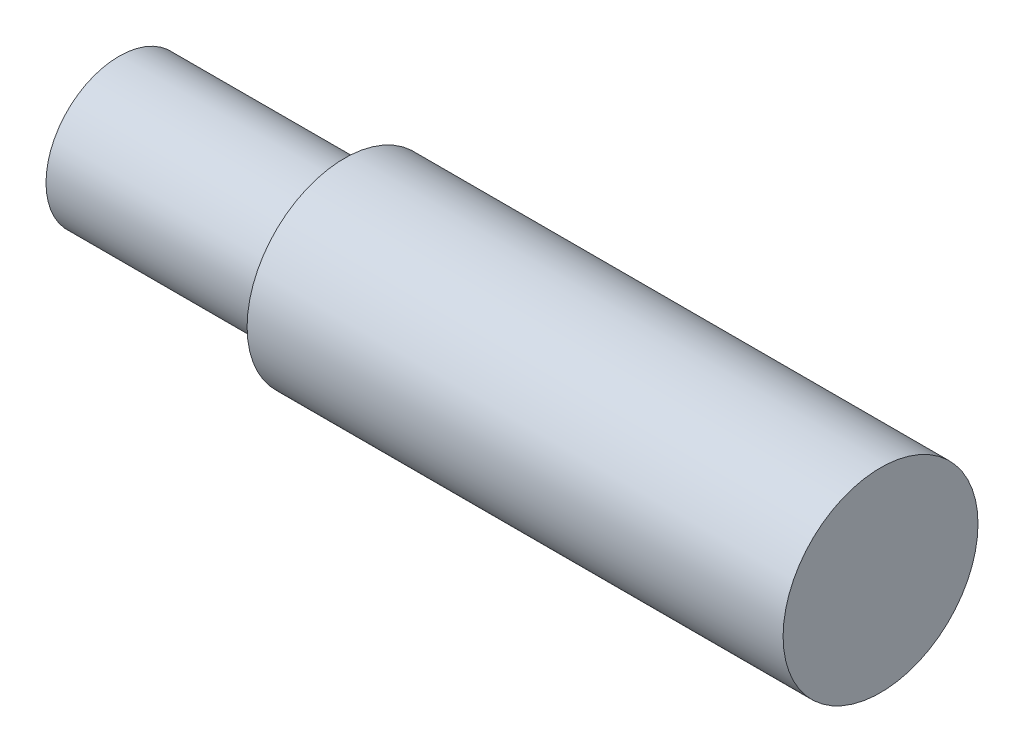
ISO-10303-21;
HEADER;
FILE_DESCRIPTION(('STEP AP214'),'2;1');
FILE_NAME('part.step','',(''),(''),'','','');
FILE_SCHEMA(('AUTOMOTIVE_DESIGN { 1 0 10303 214 1 1 1 1 }'));
ENDSEC;
DATA;
#1=APPLICATION_CONTEXT('core data for automotive mechanical design processes');
#2=APPLICATION_PROTOCOL_DEFINITION('international standard','automotive_design',2000,#1);
#3=PRODUCT_CONTEXT('',#1,'mechanical');
#4=PRODUCT('Part','Part','',(#3));
#5=PRODUCT_RELATED_PRODUCT_CATEGORY('part','',(#4));
#6=PRODUCT_DEFINITION_FORMATION('','',#4);
#7=PRODUCT_DEFINITION_CONTEXT('part definition',#1,'design');
#8=PRODUCT_DEFINITION('design','',#6,#7);
#9=PRODUCT_DEFINITION_SHAPE('','',#8);
#10=(LENGTH_UNIT() NAMED_UNIT(*) SI_UNIT(.MILLI.,.METRE.));
#11=(NAMED_UNIT(*) PLANE_ANGLE_UNIT() SI_UNIT($,.RADIAN.));
#12=(NAMED_UNIT(*) SI_UNIT($,.STERADIAN.) SOLID_ANGLE_UNIT());
#13=UNCERTAINTY_MEASURE_WITH_UNIT(LENGTH_MEASURE(1.E-05),#10,'distance_accuracy_value','');
#14=(GEOMETRIC_REPRESENTATION_CONTEXT(3) GLOBAL_UNCERTAINTY_ASSIGNED_CONTEXT((#13)) GLOBAL_UNIT_ASSIGNED_CONTEXT((#10,
#11,#12)) REPRESENTATION_CONTEXT('',''));
#15=CARTESIAN_POINT('',(0.,0.,0.));
#16=DIRECTION('',(0.,0.,1.));
#17=DIRECTION('',(1.,0.,0.));
#18=AXIS2_PLACEMENT_3D('',#15,#16,#17);
#19=CARTESIAN_POINT('',(6.40129058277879,0.,0.));
#20=DIRECTION('',(-1.,0.,0.));
#21=DIRECTION('',(0.,0.,-1.));
#22=AXIS2_PLACEMENT_3D('',#19,#20,#21);
#23=SPHERICAL_SURFACE('',#22,6.40129058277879);
#24=CARTESIAN_POINT('',(0.746511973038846,0.,0.));
#25=DIRECTION('',(-1.,0.,0.));
#26=DIRECTION('',(0.,0.,1.));
#27=AXIS2_PLACEMENT_3D('',#24,#25,#26);
#28=CIRCLE('',#27,3.);
#29=CARTESIAN_POINT('',(0.746511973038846,0.,3.));
#30=VERTEX_POINT('',#29);
#31=EDGE_CURVE('E45',#30,#30,#28,.T.);
#32=ORIENTED_EDGE('',*,*,#31,.T.);
#33=EDGE_LOOP('',(#32));
#34=FACE_BOUND('',#33,.T.);
#35=ADVANCED_FACE('F31',(#34),#23,.T.);
#36=CARTESIAN_POINT('',(32.,0.,0.));
#37=DIRECTION('',(-1.,0.,0.));
#38=DIRECTION('',(0.,0.,1.));
#39=AXIS2_PLACEMENT_3D('',#36,#37,#38);
#40=PLANE('',#39);
#41=CARTESIAN_POINT('',(32.,0.,0.));
#42=DIRECTION('',(-1.,0.,0.));
#43=DIRECTION('',(0.,0.,1.));
#44=AXIS2_PLACEMENT_3D('',#41,#42,#43);
#45=CIRCLE('',#44,4.);
#46=CARTESIAN_POINT('',(32.,0.,4.));
#47=VERTEX_POINT('',#46);
#48=EDGE_CURVE('E10',#47,#47,#45,.T.);
#49=ORIENTED_EDGE('',*,*,#48,.F.);
#50=EDGE_LOOP('',(#49));
#51=FACE_BOUND('',#50,.T.);
#52=ADVANCED_FACE('F65',(#51),#40,.F.);
#53=CARTESIAN_POINT('',(0.,0.,0.));
#54=DIRECTION('',(-1.,0.,0.));
#55=DIRECTION('',(0.,0.,1.));
#56=AXIS2_PLACEMENT_3D('',#53,#54,#55);
#57=CYLINDRICAL_SURFACE('',#56,4.);
#58=CARTESIAN_POINT('',(10.,0.,0.));
#59=DIRECTION('',(-1.,0.,0.));
#60=DIRECTION('',(0.,0.,1.));
#61=AXIS2_PLACEMENT_3D('',#58,#59,#60);
#62=CIRCLE('',#61,4.);
#63=CARTESIAN_POINT('',(10.,0.,4.));
#64=VERTEX_POINT('',#63);
#65=EDGE_CURVE('E37',#64,#64,#62,.T.);
#66=ORIENTED_EDGE('',*,*,#65,.F.);
#67=EDGE_LOOP('',(#66));
#68=FACE_BOUND('',#67,.T.);
#69=ORIENTED_EDGE('',*,*,#48,.T.);
#70=EDGE_LOOP('',(#69));
#71=FACE_BOUND('',#70,.T.);
#72=ADVANCED_FACE('F60',(#68,#71),#57,.T.);
#73=CARTESIAN_POINT('',(10.,0.,-3.));
#74=DIRECTION('',(1.,0.,0.));
#75=DIRECTION('',(0.,0.,-1.));
#76=AXIS2_PLACEMENT_3D('',#73,#74,#75);
#77=PLANE('',#76);
#78=CARTESIAN_POINT('',(10.,0.,0.));
#79=DIRECTION('',(-1.,0.,0.));
#80=DIRECTION('',(0.,0.,1.));
#81=AXIS2_PLACEMENT_3D('',#78,#79,#80);
#82=CIRCLE('',#81,3.);
#83=CARTESIAN_POINT('',(10.,0.,3.));
#84=VERTEX_POINT('',#83);
#85=EDGE_CURVE('E41',#84,#84,#82,.T.);
#86=ORIENTED_EDGE('',*,*,#85,.F.);
#87=EDGE_LOOP('',(#86));
#88=FACE_BOUND('',#87,.T.);
#89=ORIENTED_EDGE('',*,*,#65,.T.);
#90=EDGE_LOOP('',(#89));
#91=FACE_BOUND('',#90,.T.);
#92=ADVANCED_FACE('F55',(#88,#91),#77,.F.);
#93=CARTESIAN_POINT('',(0.,0.,0.));
#94=DIRECTION('',(-1.,0.,0.));
#95=DIRECTION('',(0.,0.,1.));
#96=AXIS2_PLACEMENT_3D('',#93,#94,#95);
#97=CYLINDRICAL_SURFACE('',#96,3.);
#98=ORIENTED_EDGE('',*,*,#31,.F.);
#99=EDGE_LOOP('',(#98));
#100=FACE_BOUND('',#99,.T.);
#101=ORIENTED_EDGE('',*,*,#85,.T.);
#102=EDGE_LOOP('',(#101));
#103=FACE_BOUND('',#102,.T.);
#104=ADVANCED_FACE('F52',(#100,#103),#97,.T.);
#105=CLOSED_SHELL('',(#35,#52,#72,#92,#104));
#106=MANIFOLD_SOLID_BREP('B2',#105);
#107=ADVANCED_BREP_SHAPE_REPRESENTATION('',(#18,#106),#14);
#108=SHAPE_DEFINITION_REPRESENTATION(#9,#107);
ENDSEC;
END-ISO-10303-21;
